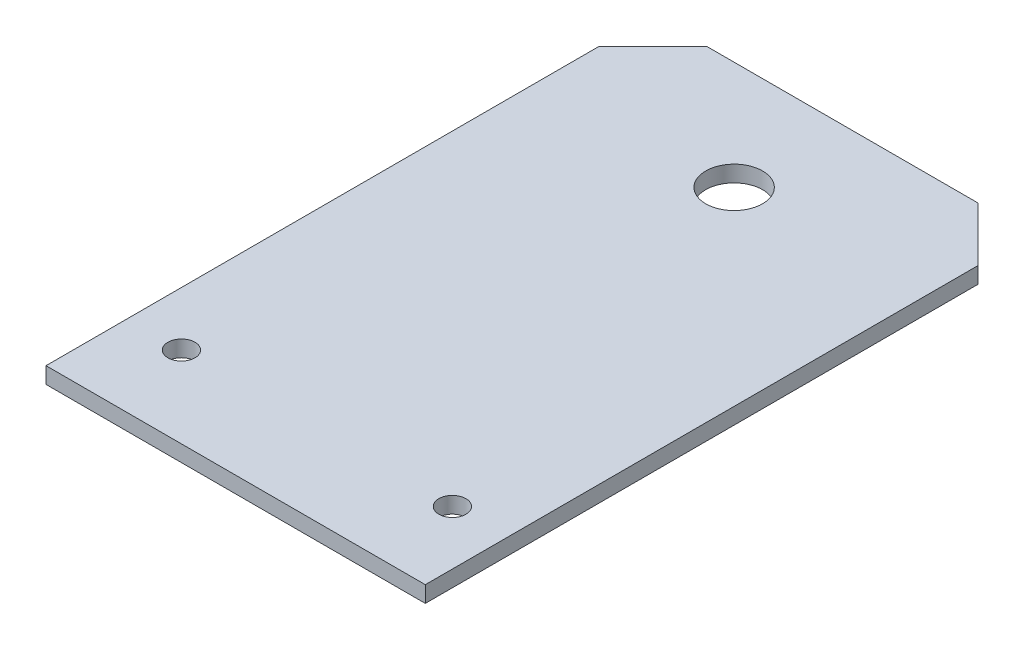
ISO-10303-21;
HEADER;
FILE_DESCRIPTION(('STEP AP214'),'2;1');
FILE_NAME('part.step','',(''),(''),'','','');
FILE_SCHEMA(('AUTOMOTIVE_DESIGN { 1 0 10303 214 1 1 1 1 }'));
ENDSEC;
DATA;
#1=APPLICATION_CONTEXT('core data for automotive mechanical design processes');
#2=APPLICATION_PROTOCOL_DEFINITION('international standard','automotive_design',2000,#1);
#3=PRODUCT_CONTEXT('',#1,'mechanical');
#4=PRODUCT('Part','Part','',(#3));
#5=PRODUCT_RELATED_PRODUCT_CATEGORY('part','',(#4));
#6=PRODUCT_DEFINITION_FORMATION('','',#4);
#7=PRODUCT_DEFINITION_CONTEXT('part definition',#1,'design');
#8=PRODUCT_DEFINITION('design','',#6,#7);
#9=PRODUCT_DEFINITION_SHAPE('','',#8);
#10=(LENGTH_UNIT() NAMED_UNIT(*) SI_UNIT(.MILLI.,.METRE.));
#11=(NAMED_UNIT(*) PLANE_ANGLE_UNIT() SI_UNIT($,.RADIAN.));
#12=(NAMED_UNIT(*) SI_UNIT($,.STERADIAN.) SOLID_ANGLE_UNIT());
#13=UNCERTAINTY_MEASURE_WITH_UNIT(LENGTH_MEASURE(1.E-05),#10,'distance_accuracy_value','');
#14=(GEOMETRIC_REPRESENTATION_CONTEXT(3) GLOBAL_UNCERTAINTY_ASSIGNED_CONTEXT((#13)) GLOBAL_UNIT_ASSIGNED_CONTEXT((#10,
#11,#12)) REPRESENTATION_CONTEXT('',''));
#15=CARTESIAN_POINT('',(0.,0.,0.));
#16=DIRECTION('',(0.,0.,1.));
#17=DIRECTION('',(1.,0.,0.));
#18=AXIS2_PLACEMENT_3D('',#15,#16,#17);
#19=CARTESIAN_POINT('',(0.,3.,-112.));
#20=DIRECTION('',(0.,-1.,0.));
#21=DIRECTION('',(0.,0.,-1.));
#22=AXIS2_PLACEMENT_3D('',#19,#20,#21);
#23=PLANE('',#22);
#24=CARTESIAN_POINT('',(10.,3.,-15.));
#25=DIRECTION('',(0.,1.,0.));
#26=DIRECTION('',(0.,0.,1.));
#27=AXIS2_PLACEMENT_3D('',#24,#25,#26);
#28=CIRCLE('',#27,2.5);
#29=CARTESIAN_POINT('',(10.,3.,-12.5));
#30=VERTEX_POINT('',#29);
#31=EDGE_CURVE('E185',#30,#30,#28,.T.);
#32=ORIENTED_EDGE('',*,*,#31,.F.);
#33=EDGE_LOOP('',(#32));
#34=FACE_BOUND('',#33,.T.);
#35=DIRECTION('',(0.,0.,1.));
#36=VECTOR('',#35,1.);
#37=CARTESIAN_POINT('',(0.,3.,0.));
#38=LINE('',#37,#36);
#39=CARTESIAN_POINT('',(0.,3.,-102.));
#40=VERTEX_POINT('',#39);
#41=CARTESIAN_POINT('',(0.,3.,0.));
#42=VERTEX_POINT('',#41);
#43=EDGE_CURVE('E129',#40,#42,#38,.T.);
#44=ORIENTED_EDGE('',*,*,#43,.T.);
#45=DIRECTION('',(1.,0.,0.));
#46=VECTOR('',#45,1.);
#47=CARTESIAN_POINT('',(0.,3.,0.));
#48=LINE('',#47,#46);
#49=CARTESIAN_POINT('',(70.,3.,0.));
#50=VERTEX_POINT('',#49);
#51=EDGE_CURVE('E87',#42,#50,#48,.T.);
#52=ORIENTED_EDGE('',*,*,#51,.T.);
#53=DIRECTION('',(0.,0.,-1.));
#54=VECTOR('',#53,1.);
#55=CARTESIAN_POINT('',(70.,3.,0.));
#56=LINE('',#55,#54);
#57=CARTESIAN_POINT('',(70.,3.,-102.));
#58=VERTEX_POINT('',#57);
#59=EDGE_CURVE('E100',#50,#58,#56,.T.);
#60=ORIENTED_EDGE('',*,*,#59,.T.);
#61=DIRECTION('',(-0.707106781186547,0.,-0.707106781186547));
#62=VECTOR('',#61,1.);
#63=CARTESIAN_POINT('',(60.,3.,-112.));
#64=LINE('',#63,#62);
#65=CARTESIAN_POINT('',(60.,3.,-112.));
#66=VERTEX_POINT('',#65);
#67=EDGE_CURVE('E94',#58,#66,#64,.T.);
#68=ORIENTED_EDGE('',*,*,#67,.T.);
#69=DIRECTION('',(-1.,0.,0.));
#70=VECTOR('',#69,1.);
#71=CARTESIAN_POINT('',(10.,3.,-112.));
#72=LINE('',#71,#70);
#73=CARTESIAN_POINT('',(10.,3.,-112.));
#74=VERTEX_POINT('',#73);
#75=EDGE_CURVE('E98',#66,#74,#72,.T.);
#76=ORIENTED_EDGE('',*,*,#75,.T.);
#77=DIRECTION('',(-0.707106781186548,0.,0.707106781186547));
#78=VECTOR('',#77,1.);
#79=CARTESIAN_POINT('',(0.,3.,-102.));
#80=LINE('',#79,#78);
#81=EDGE_CURVE('E50',#74,#40,#80,.T.);
#82=ORIENTED_EDGE('',*,*,#81,.T.);
#83=EDGE_LOOP('',(#44,#52,#60,#68,#76,#82));
#84=FACE_BOUND('',#83,.T.);
#85=CARTESIAN_POINT('',(35.,3.,-92.));
#86=DIRECTION('',(0.,1.,0.));
#87=DIRECTION('',(0.,0.,1.));
#88=AXIS2_PLACEMENT_3D('',#85,#86,#87);
#89=CIRCLE('',#88,5.25);
#90=CARTESIAN_POINT('',(35.,3.,-86.75));
#91=VERTEX_POINT('',#90);
#92=EDGE_CURVE('E122',#91,#91,#89,.T.);
#93=ORIENTED_EDGE('',*,*,#92,.F.);
#94=EDGE_LOOP('',(#93));
#95=FACE_BOUND('',#94,.T.);
#96=CARTESIAN_POINT('',(60.,3.,-15.));
#97=DIRECTION('',(0.,1.,0.));
#98=DIRECTION('',(0.,0.,1.));
#99=AXIS2_PLACEMENT_3D('',#96,#97,#98);
#100=CIRCLE('',#99,2.50000000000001);
#101=CARTESIAN_POINT('',(60.,3.,-12.5));
#102=VERTEX_POINT('',#101);
#103=EDGE_CURVE('E176',#102,#102,#100,.T.);
#104=ORIENTED_EDGE('',*,*,#103,.F.);
#105=EDGE_LOOP('',(#104));
#106=FACE_BOUND('',#105,.T.);
#107=ADVANCED_FACE('F33',(#34,#84,#95,#106),#23,.F.);
#108=CARTESIAN_POINT('',(0.,0.,-112.));
#109=DIRECTION('',(0.,-1.,0.));
#110=DIRECTION('',(0.,0.,-1.));
#111=AXIS2_PLACEMENT_3D('',#108,#109,#110);
#112=PLANE('',#111);
#113=CARTESIAN_POINT('',(10.,0.,-15.));
#114=DIRECTION('',(0.,1.,0.));
#115=DIRECTION('',(0.,0.,1.));
#116=AXIS2_PLACEMENT_3D('',#113,#114,#115);
#117=CIRCLE('',#116,2.5);
#118=CARTESIAN_POINT('',(10.,0.,-12.5));
#119=VERTEX_POINT('',#118);
#120=EDGE_CURVE('E182',#119,#119,#117,.T.);
#121=ORIENTED_EDGE('',*,*,#120,.T.);
#122=EDGE_LOOP('',(#121));
#123=FACE_BOUND('',#122,.T.);
#124=DIRECTION('',(0.,0.,1.));
#125=VECTOR('',#124,1.);
#126=CARTESIAN_POINT('',(0.,0.,0.));
#127=LINE('',#126,#125);
#128=CARTESIAN_POINT('',(0.,0.,-102.));
#129=VERTEX_POINT('',#128);
#130=CARTESIAN_POINT('',(0.,0.,0.));
#131=VERTEX_POINT('',#130);
#132=EDGE_CURVE('E118',#129,#131,#127,.T.);
#133=ORIENTED_EDGE('',*,*,#132,.F.);
#134=DIRECTION('',(-0.707106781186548,0.,0.707106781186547));
#135=VECTOR('',#134,1.);
#136=CARTESIAN_POINT('',(0.,0.,-102.));
#137=LINE('',#136,#135);
#138=CARTESIAN_POINT('',(10.,0.,-112.));
#139=VERTEX_POINT('',#138);
#140=EDGE_CURVE('E79',#139,#129,#137,.T.);
#141=ORIENTED_EDGE('',*,*,#140,.F.);
#142=DIRECTION('',(-1.,0.,0.));
#143=VECTOR('',#142,1.);
#144=CARTESIAN_POINT('',(10.,0.,-112.));
#145=LINE('',#144,#143);
#146=CARTESIAN_POINT('',(60.,0.,-112.));
#147=VERTEX_POINT('',#146);
#148=EDGE_CURVE('E73',#147,#139,#145,.T.);
#149=ORIENTED_EDGE('',*,*,#148,.F.);
#150=DIRECTION('',(-0.707106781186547,0.,-0.707106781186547));
#151=VECTOR('',#150,1.);
#152=CARTESIAN_POINT('',(60.,0.,-112.));
#153=LINE('',#152,#151);
#154=CARTESIAN_POINT('',(70.,0.,-102.));
#155=VERTEX_POINT('',#154);
#156=EDGE_CURVE('E108',#155,#147,#153,.T.);
#157=ORIENTED_EDGE('',*,*,#156,.F.);
#158=DIRECTION('',(0.,0.,-1.));
#159=VECTOR('',#158,1.);
#160=CARTESIAN_POINT('',(70.,0.,0.));
#161=LINE('',#160,#159);
#162=CARTESIAN_POINT('',(70.,0.,0.));
#163=VERTEX_POINT('',#162);
#164=EDGE_CURVE('E124',#163,#155,#161,.T.);
#165=ORIENTED_EDGE('',*,*,#164,.F.);
#166=DIRECTION('',(1.,0.,0.));
#167=VECTOR('',#166,1.);
#168=CARTESIAN_POINT('',(0.,0.,0.));
#169=LINE('',#168,#167);
#170=EDGE_CURVE('E121',#131,#163,#169,.T.);
#171=ORIENTED_EDGE('',*,*,#170,.F.);
#172=EDGE_LOOP('',(#133,#141,#149,#157,#165,#171));
#173=FACE_BOUND('',#172,.T.);
#174=CARTESIAN_POINT('',(35.,0.,-92.));
#175=DIRECTION('',(0.,1.,0.));
#176=DIRECTION('',(0.,0.,1.));
#177=AXIS2_PLACEMENT_3D('',#174,#175,#176);
#178=CIRCLE('',#177,5.25);
#179=CARTESIAN_POINT('',(35.,0.,-86.75));
#180=VERTEX_POINT('',#179);
#181=EDGE_CURVE('E188',#180,#180,#178,.T.);
#182=ORIENTED_EDGE('',*,*,#181,.T.);
#183=EDGE_LOOP('',(#182));
#184=FACE_BOUND('',#183,.T.);
#185=CARTESIAN_POINT('',(60.,0.,-15.));
#186=DIRECTION('',(0.,1.,0.));
#187=DIRECTION('',(0.,0.,1.));
#188=AXIS2_PLACEMENT_3D('',#185,#186,#187);
#189=CIRCLE('',#188,2.50000000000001);
#190=CARTESIAN_POINT('',(60.,0.,-12.5));
#191=VERTEX_POINT('',#190);
#192=EDGE_CURVE('E179',#191,#191,#189,.T.);
#193=ORIENTED_EDGE('',*,*,#192,.T.);
#194=EDGE_LOOP('',(#193));
#195=FACE_BOUND('',#194,.T.);
#196=ADVANCED_FACE('F138',(#123,#173,#184,#195),#112,.T.);
#197=CARTESIAN_POINT('',(0.,3.,0.));
#198=DIRECTION('',(1.,0.,0.));
#199=DIRECTION('',(0.,0.,-1.));
#200=AXIS2_PLACEMENT_3D('',#197,#198,#199);
#201=PLANE('',#200);
#202=ORIENTED_EDGE('',*,*,#132,.T.);
#203=DIRECTION('',(0.,-1.,0.));
#204=VECTOR('',#203,1.);
#205=CARTESIAN_POINT('',(0.,3.,0.));
#206=LINE('',#205,#204);
#207=EDGE_CURVE('E11',#42,#131,#206,.T.);
#208=ORIENTED_EDGE('',*,*,#207,.F.);
#209=ORIENTED_EDGE('',*,*,#43,.F.);
#210=DIRECTION('',(0.,-1.,0.));
#211=VECTOR('',#210,1.);
#212=CARTESIAN_POINT('',(0.,3.,-102.));
#213=LINE('',#212,#211);
#214=EDGE_CURVE('E114',#40,#129,#213,.T.);
#215=ORIENTED_EDGE('',*,*,#214,.T.);
#216=EDGE_LOOP('',(#202,#208,#209,#215));
#217=FACE_BOUND('',#216,.T.);
#218=ADVANCED_FACE('F35',(#217),#201,.F.);
#219=CARTESIAN_POINT('',(0.,3.,0.));
#220=DIRECTION('',(0.,0.,-1.));
#221=DIRECTION('',(-1.,0.,0.));
#222=AXIS2_PLACEMENT_3D('',#219,#220,#221);
#223=PLANE('',#222);
#224=ORIENTED_EDGE('',*,*,#170,.T.);
#225=DIRECTION('',(0.,-1.,0.));
#226=VECTOR('',#225,1.);
#227=CARTESIAN_POINT('',(70.,3.,0.));
#228=LINE('',#227,#226);
#229=EDGE_CURVE('E42',#50,#163,#228,.T.);
#230=ORIENTED_EDGE('',*,*,#229,.F.);
#231=ORIENTED_EDGE('',*,*,#51,.F.);
#232=ORIENTED_EDGE('',*,*,#207,.T.);
#233=EDGE_LOOP('',(#224,#230,#231,#232));
#234=FACE_BOUND('',#233,.T.);
#235=ADVANCED_FACE('F243',(#234),#223,.F.);
#236=CARTESIAN_POINT('',(70.,3.,0.));
#237=DIRECTION('',(-1.,0.,0.));
#238=DIRECTION('',(0.,0.,1.));
#239=AXIS2_PLACEMENT_3D('',#236,#237,#238);
#240=PLANE('',#239);
#241=ORIENTED_EDGE('',*,*,#164,.T.);
#242=DIRECTION('',(0.,-1.,0.));
#243=VECTOR('',#242,1.);
#244=CARTESIAN_POINT('',(70.,3.,-102.));
#245=LINE('',#244,#243);
#246=EDGE_CURVE('E109',#58,#155,#245,.T.);
#247=ORIENTED_EDGE('',*,*,#246,.F.);
#248=ORIENTED_EDGE('',*,*,#59,.F.);
#249=ORIENTED_EDGE('',*,*,#229,.T.);
#250=EDGE_LOOP('',(#241,#247,#248,#249));
#251=FACE_BOUND('',#250,.T.);
#252=ADVANCED_FACE('F135',(#251),#240,.F.);
#253=CARTESIAN_POINT('',(60.,3.,-112.));
#254=DIRECTION('',(-0.707106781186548,0.,0.707106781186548));
#255=DIRECTION('',(0.707106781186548,0.,0.707106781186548));
#256=AXIS2_PLACEMENT_3D('',#253,#254,#255);
#257=PLANE('',#256);
#258=ORIENTED_EDGE('',*,*,#156,.T.);
#259=DIRECTION('',(0.,-1.,0.));
#260=VECTOR('',#259,1.);
#261=CARTESIAN_POINT('',(60.,3.,-112.));
#262=LINE('',#261,#260);
#263=EDGE_CURVE('E105',#66,#147,#262,.T.);
#264=ORIENTED_EDGE('',*,*,#263,.F.);
#265=ORIENTED_EDGE('',*,*,#67,.F.);
#266=ORIENTED_EDGE('',*,*,#246,.T.);
#267=EDGE_LOOP('',(#258,#264,#265,#266));
#268=FACE_BOUND('',#267,.T.);
#269=ADVANCED_FACE('F106',(#268),#257,.F.);
#270=CARTESIAN_POINT('',(10.,3.,-112.));
#271=DIRECTION('',(0.,0.,1.));
#272=DIRECTION('',(1.,0.,0.));
#273=AXIS2_PLACEMENT_3D('',#270,#271,#272);
#274=PLANE('',#273);
#275=ORIENTED_EDGE('',*,*,#148,.T.);
#276=DIRECTION('',(0.,-1.,0.));
#277=VECTOR('',#276,1.);
#278=CARTESIAN_POINT('',(10.,3.,-112.));
#279=LINE('',#278,#277);
#280=EDGE_CURVE('E110',#74,#139,#279,.T.);
#281=ORIENTED_EDGE('',*,*,#280,.F.);
#282=ORIENTED_EDGE('',*,*,#75,.F.);
#283=ORIENTED_EDGE('',*,*,#263,.T.);
#284=EDGE_LOOP('',(#275,#281,#282,#283));
#285=FACE_BOUND('',#284,.T.);
#286=ADVANCED_FACE('F112',(#285),#274,.F.);
#287=CARTESIAN_POINT('',(0.,3.,-102.));
#288=DIRECTION('',(0.707106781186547,0.,0.707106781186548));
#289=DIRECTION('',(0.707106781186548,0.,-0.707106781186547));
#290=AXIS2_PLACEMENT_3D('',#287,#288,#289);
#291=PLANE('',#290);
#292=ORIENTED_EDGE('',*,*,#140,.T.);
#293=ORIENTED_EDGE('',*,*,#214,.F.);
#294=ORIENTED_EDGE('',*,*,#81,.F.);
#295=ORIENTED_EDGE('',*,*,#280,.T.);
#296=EDGE_LOOP('',(#292,#293,#294,#295));
#297=FACE_BOUND('',#296,.T.);
#298=ADVANCED_FACE('F143',(#297),#291,.F.);
#299=CARTESIAN_POINT('',(35.,3.,-92.));
#300=DIRECTION('',(0.,-1.,0.));
#301=DIRECTION('',(0.,0.,-1.));
#302=AXIS2_PLACEMENT_3D('',#299,#300,#301);
#303=CYLINDRICAL_SURFACE('',#302,5.25);
#304=ORIENTED_EDGE('',*,*,#92,.T.);
#305=EDGE_LOOP('',(#304));
#306=FACE_BOUND('',#305,.T.);
#307=ORIENTED_EDGE('',*,*,#181,.F.);
#308=EDGE_LOOP('',(#307));
#309=FACE_BOUND('',#308,.T.);
#310=ADVANCED_FACE('F145',(#306,#309),#303,.F.);
#311=CARTESIAN_POINT('',(10.,3.,-15.));
#312=DIRECTION('',(0.,-1.,0.));
#313=DIRECTION('',(0.,0.,-1.));
#314=AXIS2_PLACEMENT_3D('',#311,#312,#313);
#315=CYLINDRICAL_SURFACE('',#314,2.5);
#316=ORIENTED_EDGE('',*,*,#31,.T.);
#317=EDGE_LOOP('',(#316));
#318=FACE_BOUND('',#317,.T.);
#319=ORIENTED_EDGE('',*,*,#120,.F.);
#320=EDGE_LOOP('',(#319));
#321=FACE_BOUND('',#320,.T.);
#322=ADVANCED_FACE('F151',(#318,#321),#315,.F.);
#323=CARTESIAN_POINT('',(60.,3.,-15.));
#324=DIRECTION('',(0.,-1.,0.));
#325=DIRECTION('',(0.,0.,-1.));
#326=AXIS2_PLACEMENT_3D('',#323,#324,#325);
#327=CYLINDRICAL_SURFACE('',#326,2.50000000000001);
#328=ORIENTED_EDGE('',*,*,#103,.T.);
#329=EDGE_LOOP('',(#328));
#330=FACE_BOUND('',#329,.T.);
#331=ORIENTED_EDGE('',*,*,#192,.F.);
#332=EDGE_LOOP('',(#331));
#333=FACE_BOUND('',#332,.T.);
#334=ADVANCED_FACE('F167',(#330,#333),#327,.F.);
#335=CLOSED_SHELL('',(#107,#196,#218,#235,#252,#269,#286,#298,#310,#322,#334));
#336=MANIFOLD_SOLID_BREP('B2',#335);
#337=ADVANCED_BREP_SHAPE_REPRESENTATION('',(#18,#336),#14);
#338=SHAPE_DEFINITION_REPRESENTATION(#9,#337);
ENDSEC;
END-ISO-10303-21;
